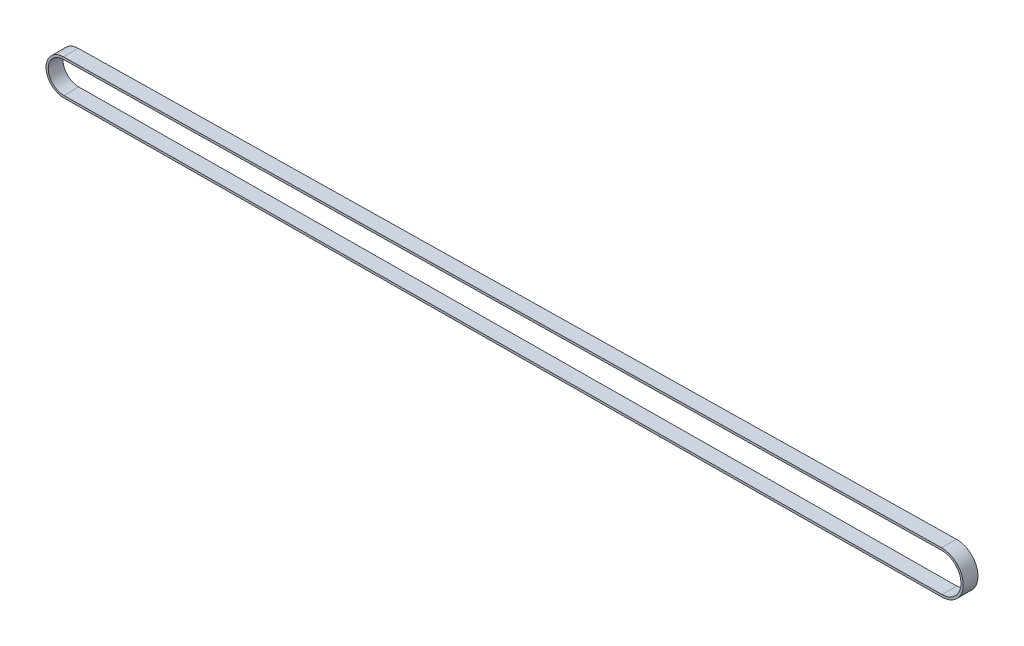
ISO-10303-21;
HEADER;
FILE_DESCRIPTION(('STEP AP214'),'2;1');
FILE_NAME('part.step','',(''),(''),'','','');
FILE_SCHEMA(('AUTOMOTIVE_DESIGN { 1 0 10303 214 1 1 1 1 }'));
ENDSEC;
DATA;
#1=APPLICATION_CONTEXT('core data for automotive mechanical design processes');
#2=APPLICATION_PROTOCOL_DEFINITION('international standard','automotive_design',2000,#1);
#3=PRODUCT_CONTEXT('',#1,'mechanical');
#4=PRODUCT('Part','Part','',(#3));
#5=PRODUCT_RELATED_PRODUCT_CATEGORY('part','',(#4));
#6=PRODUCT_DEFINITION_FORMATION('','',#4);
#7=PRODUCT_DEFINITION_CONTEXT('part definition',#1,'design');
#8=PRODUCT_DEFINITION('design','',#6,#7);
#9=PRODUCT_DEFINITION_SHAPE('','',#8);
#10=(LENGTH_UNIT() NAMED_UNIT(*) SI_UNIT(.MILLI.,.METRE.));
#11=(NAMED_UNIT(*) PLANE_ANGLE_UNIT() SI_UNIT($,.RADIAN.));
#12=(NAMED_UNIT(*) SI_UNIT($,.STERADIAN.) SOLID_ANGLE_UNIT());
#13=UNCERTAINTY_MEASURE_WITH_UNIT(LENGTH_MEASURE(1.E-05),#10,'distance_accuracy_value','');
#14=(GEOMETRIC_REPRESENTATION_CONTEXT(3) GLOBAL_UNCERTAINTY_ASSIGNED_CONTEXT((#13)) GLOBAL_UNIT_ASSIGNED_CONTEXT((#10,
#11,#12)) REPRESENTATION_CONTEXT('',''));
#15=CARTESIAN_POINT('',(0.,0.,0.));
#16=DIRECTION('',(0.,0.,1.));
#17=DIRECTION('',(1.,0.,0.));
#18=AXIS2_PLACEMENT_3D('',#15,#16,#17);
#19=CARTESIAN_POINT('',(14.8456199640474,-41.5350683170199,2.5));
#20=DIRECTION('',(0.,0.,-1.));
#21=DIRECTION('',(-1.,0.,0.));
#22=AXIS2_PLACEMENT_3D('',#19,#20,#21);
#23=CYLINDRICAL_SURFACE('',#22,5.975);
#24=CARTESIAN_POINT('',(14.8456199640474,-41.5350683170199,-2.5));
#25=DIRECTION('',(0.,0.,-1.));
#26=DIRECTION('',(-1.,0.,0.));
#27=AXIS2_PLACEMENT_3D('',#24,#25,#26);
#28=CIRCLE('',#27,5.975);
#29=CARTESIAN_POINT('',(14.8918887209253,-47.5098891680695,-2.5));
#30=VERTEX_POINT('',#29);
#31=CARTESIAN_POINT('',(14.7509528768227,-35.5608183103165,-2.5));
#32=VERTEX_POINT('',#31);
#33=EDGE_CURVE('E166',#30,#32,#28,.T.);
#34=ORIENTED_EDGE('',*,*,#33,.F.);
#35=DIRECTION('',(0.,0.,-1.));
#36=VECTOR('',#35,1.);
#37=CARTESIAN_POINT('',(14.8918887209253,-47.5098891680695,2.5));
#38=LINE('',#37,#36);
#39=CARTESIAN_POINT('',(14.8918887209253,-47.5098891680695,2.5));
#40=VERTEX_POINT('',#39);
#41=EDGE_CURVE('E14',#40,#30,#38,.T.);
#42=ORIENTED_EDGE('',*,*,#41,.F.);
#43=CARTESIAN_POINT('',(14.8456199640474,-41.5350683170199,2.5));
#44=DIRECTION('',(0.,0.,-1.));
#45=DIRECTION('',(-1.,0.,0.));
#46=AXIS2_PLACEMENT_3D('',#43,#44,#45);
#47=CIRCLE('',#46,5.975);
#48=CARTESIAN_POINT('',(14.7509528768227,-35.5608183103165,2.5));
#49=VERTEX_POINT('',#48);
#50=EDGE_CURVE('E170',#40,#49,#47,.T.);
#51=ORIENTED_EDGE('',*,*,#50,.T.);
#52=DIRECTION('',(0.,0.,-1.));
#53=VECTOR('',#52,1.);
#54=CARTESIAN_POINT('',(14.7509528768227,-35.5608183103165,2.5));
#55=LINE('',#54,#53);
#56=EDGE_CURVE('E71',#49,#32,#55,.T.);
#57=ORIENTED_EDGE('',*,*,#56,.T.);
#58=EDGE_LOOP('',(#34,#42,#51,#57));
#59=FACE_BOUND('',#58,.T.);
#60=ADVANCED_FACE('F68',(#59),#23,.T.);
#61=CARTESIAN_POINT('',(14.8918887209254,-47.5098891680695,2.5));
#62=DIRECTION('',(0.00774372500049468,-0.999970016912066,0.));
#63=DIRECTION('',(0.999970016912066,0.00774372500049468,0.));
#64=AXIS2_PLACEMENT_3D('',#61,#62,#63);
#65=PLANE('',#64);
#66=DIRECTION('',(-0.999970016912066,-0.00774372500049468,0.));
#67=VECTOR('',#66,1.);
#68=CARTESIAN_POINT('',(14.8918887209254,-47.5098891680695,-2.5));
#69=LINE('',#68,#67);
#70=CARTESIAN_POINT('',(311.151181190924,-45.2156698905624,-2.5));
#71=VERTEX_POINT('',#70);
#72=EDGE_CURVE('E174',#71,#30,#69,.T.);
#73=ORIENTED_EDGE('',*,*,#72,.F.);
#74=DIRECTION('',(0.,0.,-1.));
#75=VECTOR('',#74,1.);
#76=CARTESIAN_POINT('',(311.151181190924,-45.2156698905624,2.5));
#77=LINE('',#76,#75);
#78=CARTESIAN_POINT('',(311.151181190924,-45.2156698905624,2.5));
#79=VERTEX_POINT('',#78);
#80=EDGE_CURVE('E76',#79,#71,#77,.T.);
#81=ORIENTED_EDGE('',*,*,#80,.F.);
#82=DIRECTION('',(-0.999970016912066,-0.00774372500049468,0.));
#83=VECTOR('',#82,1.);
#84=CARTESIAN_POINT('',(14.8918887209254,-47.5098891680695,2.5));
#85=LINE('',#84,#83);
#86=EDGE_CURVE('E180',#79,#40,#85,.T.);
#87=ORIENTED_EDGE('',*,*,#86,.T.);
#88=ORIENTED_EDGE('',*,*,#41,.T.);
#89=EDGE_LOOP('',(#73,#81,#87,#88));
#90=FACE_BOUND('',#89,.T.);
#91=ADVANCED_FACE('F206',(#90),#65,.T.);
#92=CARTESIAN_POINT('',(311.095619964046,-38.0408850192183,2.5));
#93=DIRECTION('',(0.,0.,-1.));
#94=DIRECTION('',(-1.,0.,0.));
#95=AXIS2_PLACEMENT_3D('',#92,#93,#94);
#96=CYLINDRICAL_SURFACE('',#95,7.175);
#97=CARTESIAN_POINT('',(311.095619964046,-38.0408850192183,-2.5));
#98=DIRECTION('',(0.,0.,-1.));
#99=DIRECTION('',(-1.,0.,0.));
#100=AXIS2_PLACEMENT_3D('',#97,#98,#99);
#101=CIRCLE('',#100,7.175);
#102=CARTESIAN_POINT('',(310.981940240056,-30.8667856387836,-2.5));
#103=VERTEX_POINT('',#102);
#104=EDGE_CURVE('E188',#103,#71,#101,.T.);
#105=ORIENTED_EDGE('',*,*,#104,.F.);
#106=DIRECTION('',(0.,0.,-1.));
#107=VECTOR('',#106,1.);
#108=CARTESIAN_POINT('',(310.981940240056,-30.8667856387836,2.5));
#109=LINE('',#108,#107);
#110=CARTESIAN_POINT('',(310.981940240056,-30.8667856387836,2.5));
#111=VERTEX_POINT('',#110);
#112=EDGE_CURVE('E193',#111,#103,#109,.T.);
#113=ORIENTED_EDGE('',*,*,#112,.F.);
#114=CARTESIAN_POINT('',(311.095619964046,-38.0408850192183,2.5));
#115=DIRECTION('',(0.,0.,-1.));
#116=DIRECTION('',(-1.,0.,0.));
#117=AXIS2_PLACEMENT_3D('',#114,#115,#116);
#118=CIRCLE('',#117,7.175);
#119=EDGE_CURVE('E177',#111,#79,#118,.T.);
#120=ORIENTED_EDGE('',*,*,#119,.T.);
#121=ORIENTED_EDGE('',*,*,#80,.T.);
#122=EDGE_LOOP('',(#105,#113,#120,#121));
#123=FACE_BOUND('',#122,.T.);
#124=ADVANCED_FACE('F210',(#123),#96,.T.);
#125=CARTESIAN_POINT('',(14.7509528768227,-35.5608183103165,2.5));
#126=DIRECTION('',(-0.0158438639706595,0.999874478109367,0.));
#127=DIRECTION('',(-0.999874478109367,-0.0158438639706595,0.));
#128=AXIS2_PLACEMENT_3D('',#125,#126,#127);
#129=PLANE('',#128);
#130=DIRECTION('',(0.999874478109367,0.0158438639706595,0.));
#131=VECTOR('',#130,1.);
#132=CARTESIAN_POINT('',(14.7509528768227,-35.5608183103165,-2.5));
#133=LINE('',#132,#131);
#134=EDGE_CURVE('E185',#32,#103,#133,.T.);
#135=ORIENTED_EDGE('',*,*,#134,.F.);
#136=ORIENTED_EDGE('',*,*,#56,.F.);
#137=DIRECTION('',(0.999874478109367,0.0158438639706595,0.));
#138=VECTOR('',#137,1.);
#139=CARTESIAN_POINT('',(14.7509528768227,-35.5608183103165,2.5));
#140=LINE('',#139,#138);
#141=EDGE_CURVE('E173',#49,#111,#140,.T.);
#142=ORIENTED_EDGE('',*,*,#141,.T.);
#143=ORIENTED_EDGE('',*,*,#112,.T.);
#144=EDGE_LOOP('',(#135,#136,#142,#143));
#145=FACE_BOUND('',#144,.T.);
#146=ADVANCED_FACE('F201',(#145),#129,.T.);
#147=CARTESIAN_POINT('',(14.8456199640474,-41.5350683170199,2.5));
#148=DIRECTION('',(0.,0.,-1.));
#149=DIRECTION('',(-1.,0.,0.));
#150=AXIS2_PLACEMENT_3D('',#147,#148,#149);
#151=PLANE('',#150);
#152=DIRECTION('',(-0.999970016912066,-0.00774372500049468,0.));
#153=VECTOR('',#152,1.);
#154=CARTESIAN_POINT('',(311.145373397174,-44.4656923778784,2.5));
#155=LINE('',#154,#153);
#156=CARTESIAN_POINT('',(311.145373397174,-44.4656923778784,2.5));
#157=VERTEX_POINT('',#156);
#158=CARTESIAN_POINT('',(14.886080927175,-46.7599116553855,2.5));
#159=VERTEX_POINT('',#158);
#160=EDGE_CURVE('E141',#157,#159,#155,.T.);
#161=ORIENTED_EDGE('',*,*,#160,.T.);
#162=CARTESIAN_POINT('',(14.8456199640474,-41.5350683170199,2.5));
#163=DIRECTION('',(0.,0.,-1.));
#164=DIRECTION('',(-1.,0.,0.));
#165=AXIS2_PLACEMENT_3D('',#162,#163,#164);
#166=CIRCLE('',#165,5.225);
#167=CARTESIAN_POINT('',(14.7628357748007,-36.3107241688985,2.5));
#168=VERTEX_POINT('',#167);
#169=EDGE_CURVE('E135',#159,#168,#166,.T.);
#170=ORIENTED_EDGE('',*,*,#169,.T.);
#171=DIRECTION('',(0.999874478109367,0.0158438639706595,0.));
#172=VECTOR('',#171,1.);
#173=CARTESIAN_POINT('',(14.7628357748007,-36.3107241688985,2.5));
#174=LINE('',#173,#172);
#175=CARTESIAN_POINT('',(310.993823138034,-31.6166914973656,2.5));
#176=VERTEX_POINT('',#175);
#177=EDGE_CURVE('E144',#168,#176,#174,.T.);
#178=ORIENTED_EDGE('',*,*,#177,.T.);
#179=CARTESIAN_POINT('',(311.095619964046,-38.0408850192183,2.5));
#180=DIRECTION('',(0.,0.,-1.));
#181=DIRECTION('',(-1.,0.,0.));
#182=AXIS2_PLACEMENT_3D('',#179,#180,#181);
#183=CIRCLE('',#182,6.425);
#184=EDGE_CURVE('E84',#176,#157,#183,.T.);
#185=ORIENTED_EDGE('',*,*,#184,.T.);
#186=EDGE_LOOP('',(#161,#170,#178,#185));
#187=FACE_BOUND('',#186,.T.);
#188=ORIENTED_EDGE('',*,*,#50,.F.);
#189=ORIENTED_EDGE('',*,*,#86,.F.);
#190=ORIENTED_EDGE('',*,*,#119,.F.);
#191=ORIENTED_EDGE('',*,*,#141,.F.);
#192=EDGE_LOOP('',(#188,#189,#190,#191));
#193=FACE_BOUND('',#192,.T.);
#194=ADVANCED_FACE('F148',(#187,#193),#151,.F.);
#195=CARTESIAN_POINT('',(14.8456199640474,-41.5350683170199,-2.5));
#196=DIRECTION('',(0.,0.,-1.));
#197=DIRECTION('',(-1.,0.,0.));
#198=AXIS2_PLACEMENT_3D('',#195,#196,#197);
#199=PLANE('',#198);
#200=CARTESIAN_POINT('',(14.8456199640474,-41.5350683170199,-2.5));
#201=DIRECTION('',(0.,0.,-1.));
#202=DIRECTION('',(-1.,0.,0.));
#203=AXIS2_PLACEMENT_3D('',#200,#201,#202);
#204=CIRCLE('',#203,5.225);
#205=CARTESIAN_POINT('',(14.886080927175,-46.7599116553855,-2.5));
#206=VERTEX_POINT('',#205);
#207=CARTESIAN_POINT('',(14.7628357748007,-36.3107241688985,-2.5));
#208=VERTEX_POINT('',#207);
#209=EDGE_CURVE('E92',#206,#208,#204,.T.);
#210=ORIENTED_EDGE('',*,*,#209,.F.);
#211=DIRECTION('',(-0.999970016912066,-0.00774372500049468,0.));
#212=VECTOR('',#211,1.);
#213=CARTESIAN_POINT('',(311.145373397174,-44.4656923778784,-2.5));
#214=LINE('',#213,#212);
#215=CARTESIAN_POINT('',(311.145373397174,-44.4656923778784,-2.5));
#216=VERTEX_POINT('',#215);
#217=EDGE_CURVE('E151',#216,#206,#214,.T.);
#218=ORIENTED_EDGE('',*,*,#217,.F.);
#219=CARTESIAN_POINT('',(311.095619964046,-38.0408850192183,-2.5));
#220=DIRECTION('',(0.,0.,-1.));
#221=DIRECTION('',(-1.,0.,0.));
#222=AXIS2_PLACEMENT_3D('',#219,#220,#221);
#223=CIRCLE('',#222,6.425);
#224=CARTESIAN_POINT('',(310.993823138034,-31.6166914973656,-2.5));
#225=VERTEX_POINT('',#224);
#226=EDGE_CURVE('E154',#225,#216,#223,.T.);
#227=ORIENTED_EDGE('',*,*,#226,.F.);
#228=DIRECTION('',(0.999874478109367,0.0158438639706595,0.));
#229=VECTOR('',#228,1.);
#230=CARTESIAN_POINT('',(14.7628357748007,-36.3107241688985,-2.5));
#231=LINE('',#230,#229);
#232=EDGE_CURVE('E160',#208,#225,#231,.T.);
#233=ORIENTED_EDGE('',*,*,#232,.F.);
#234=EDGE_LOOP('',(#210,#218,#227,#233));
#235=FACE_BOUND('',#234,.T.);
#236=ORIENTED_EDGE('',*,*,#33,.T.);
#237=ORIENTED_EDGE('',*,*,#134,.T.);
#238=ORIENTED_EDGE('',*,*,#104,.T.);
#239=ORIENTED_EDGE('',*,*,#72,.T.);
#240=EDGE_LOOP('',(#236,#237,#238,#239));
#241=FACE_BOUND('',#240,.T.);
#242=ADVANCED_FACE('F203',(#235,#241),#199,.T.);
#243=CARTESIAN_POINT('',(14.8456199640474,-41.5350683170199,2.5));
#244=DIRECTION('',(0.,0.,-1.));
#245=DIRECTION('',(-1.,0.,0.));
#246=AXIS2_PLACEMENT_3D('',#243,#244,#245);
#247=CYLINDRICAL_SURFACE('',#246,5.225);
#248=ORIENTED_EDGE('',*,*,#209,.T.);
#249=DIRECTION('',(0.,0.,-1.));
#250=VECTOR('',#249,1.);
#251=CARTESIAN_POINT('',(14.7628357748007,-36.3107241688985,2.5));
#252=LINE('',#251,#250);
#253=EDGE_CURVE('E131',#168,#208,#252,.T.);
#254=ORIENTED_EDGE('',*,*,#253,.F.);
#255=ORIENTED_EDGE('',*,*,#169,.F.);
#256=DIRECTION('',(0.,0.,-1.));
#257=VECTOR('',#256,1.);
#258=CARTESIAN_POINT('',(14.886080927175,-46.7599116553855,2.5));
#259=LINE('',#258,#257);
#260=EDGE_CURVE('E164',#159,#206,#259,.T.);
#261=ORIENTED_EDGE('',*,*,#260,.T.);
#262=EDGE_LOOP('',(#248,#254,#255,#261));
#263=FACE_BOUND('',#262,.T.);
#264=ADVANCED_FACE('F133',(#263),#247,.F.);
#265=CARTESIAN_POINT('',(311.145373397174,-44.4656923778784,2.5));
#266=DIRECTION('',(0.00774372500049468,-0.999970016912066,0.));
#267=DIRECTION('',(0.999970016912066,0.00774372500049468,0.));
#268=AXIS2_PLACEMENT_3D('',#265,#266,#267);
#269=PLANE('',#268);
#270=ORIENTED_EDGE('',*,*,#217,.T.);
#271=ORIENTED_EDGE('',*,*,#260,.F.);
#272=ORIENTED_EDGE('',*,*,#160,.F.);
#273=DIRECTION('',(0.,0.,-1.));
#274=VECTOR('',#273,1.);
#275=CARTESIAN_POINT('',(311.145373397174,-44.4656923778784,2.5));
#276=LINE('',#275,#274);
#277=EDGE_CURVE('E167',#157,#216,#276,.T.);
#278=ORIENTED_EDGE('',*,*,#277,.T.);
#279=EDGE_LOOP('',(#270,#271,#272,#278));
#280=FACE_BOUND('',#279,.T.);
#281=ADVANCED_FACE('F261',(#280),#269,.F.);
#282=CARTESIAN_POINT('',(311.095619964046,-38.0408850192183,2.5));
#283=DIRECTION('',(0.,0.,-1.));
#284=DIRECTION('',(-1.,0.,0.));
#285=AXIS2_PLACEMENT_3D('',#282,#283,#284);
#286=CYLINDRICAL_SURFACE('',#285,6.425);
#287=ORIENTED_EDGE('',*,*,#226,.T.);
#288=ORIENTED_EDGE('',*,*,#277,.F.);
#289=ORIENTED_EDGE('',*,*,#184,.F.);
#290=DIRECTION('',(0.,0.,-1.));
#291=VECTOR('',#290,1.);
#292=CARTESIAN_POINT('',(310.993823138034,-31.6166914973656,2.5));
#293=LINE('',#292,#291);
#294=EDGE_CURVE('E140',#176,#225,#293,.T.);
#295=ORIENTED_EDGE('',*,*,#294,.T.);
#296=EDGE_LOOP('',(#287,#288,#289,#295));
#297=FACE_BOUND('',#296,.T.);
#298=ADVANCED_FACE('F270',(#297),#286,.F.);
#299=CARTESIAN_POINT('',(14.7628357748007,-36.3107241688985,2.5));
#300=DIRECTION('',(-0.0158438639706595,0.999874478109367,0.));
#301=DIRECTION('',(-0.999874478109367,-0.0158438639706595,0.));
#302=AXIS2_PLACEMENT_3D('',#299,#300,#301);
#303=PLANE('',#302);
#304=ORIENTED_EDGE('',*,*,#232,.T.);
#305=ORIENTED_EDGE('',*,*,#294,.F.);
#306=ORIENTED_EDGE('',*,*,#177,.F.);
#307=ORIENTED_EDGE('',*,*,#253,.T.);
#308=EDGE_LOOP('',(#304,#305,#306,#307));
#309=FACE_BOUND('',#308,.T.);
#310=ADVANCED_FACE('F145',(#309),#303,.F.);
#311=CLOSED_SHELL('',(#60,#91,#124,#146,#194,#242,#264,#281,#298,#310));
#312=MANIFOLD_SOLID_BREP('B2',#311);
#313=ADVANCED_BREP_SHAPE_REPRESENTATION('',(#18,#312),#14);
#314=SHAPE_DEFINITION_REPRESENTATION(#9,#313);
ENDSEC;
END-ISO-10303-21;
